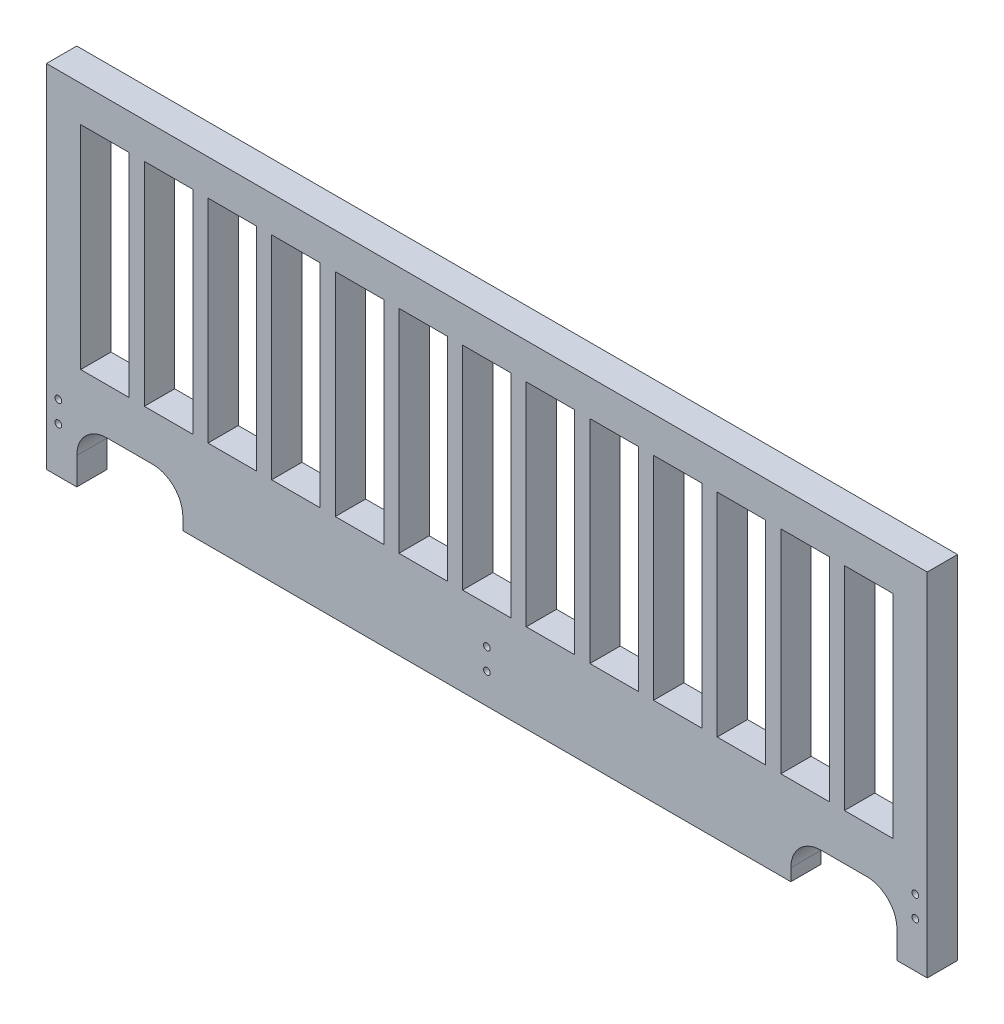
from build123d import *

# Parameters (mm, degrees)
ESQUISSE5_R      = 1.1
ESQUISSE5_W      = 16
ESQUISSE5_H      = 70
ESQUISSE5_W_2    = 15.999999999
EXTRUSION1_DEPTH = 10


with BuildPart() as part:
    # Esquisse5 → Extrusion1 (new body)
    with BuildSketch(Plane.XY):
        with BuildLine():
            Line((-3.926990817, 116), (286.670329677, 116))
            Line((286.670329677, 116), (286.673301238, 4e-09))
            Line((286.673301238, 4e-09), (276.673301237, 4e-09))
            Line((276.673301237, 4e-09), (276.673301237, 9))
            ThreePointArc((276.673301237, 9), (273.744369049, 16.071067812), (266.673301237, 19))
            Line((266.673301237, 19), (251.673301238, 19))
            ThreePointArc((251.673301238, 19), (244.602233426, 16.071067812), (241.673301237, 9))
            Line((241.673301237, 9), (241.673301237, 5))
            Line((241.673301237, 5), (41.073009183, 5))
            Line((41.073009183, 5), (41.073009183, 9))
            ThreePointArc((41.073009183, 9), (38.144076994, 16.071067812), (31.073009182, 19))
            Line((31.073009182, 19), (16.073009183, 19))
            ThreePointArc((16.073009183, 19), (9.001941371, 16.071067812), (6.073009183, 9))
            Line((6.073009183, 9), (6.073009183, 4e-09))
            Line((6.073009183, 4e-09), (-3.926990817, 4e-09))
            Line((-3.926990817, 4e-09), (-3.926990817, 116))
        make_face()
        with Locations((0, 22)):
            Circle(ESQUISSE5_R, mode=Mode.SUBTRACT)
        with Locations((141.37315521, 22)):
            Circle(ESQUISSE5_R, mode=Mode.SUBTRACT)
        with Locations((282.74333886, 22)):
            Circle(ESQUISSE5_R, mode=Mode.SUBTRACT)
        with Locations((0, 15)):
            Circle(ESQUISSE5_R, mode=Mode.SUBTRACT)
        with Locations((141.37315521, 15)):
            Circle(ESQUISSE5_R, mode=Mode.SUBTRACT)
        with Locations((282.74333886, 15)):
            Circle(ESQUISSE5_R, mode=Mode.SUBTRACT)
        Polygon((28.373009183, 104.2), (44.373009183, 104.2), (44.373009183, 34.2), (28.373009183, 34.2), align=None, mode=Mode.SUBTRACT)
        with Locations((15.373009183, 69.2)):
            Rectangle(ESQUISSE5_W, ESQUISSE5_H, mode=Mode.SUBTRACT)
        with Locations((57.373009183, 69.2)):
            Rectangle(ESQUISSE5_W, ESQUISSE5_H, mode=Mode.SUBTRACT)
        with Locations((78.373009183, 69.2)):
            Rectangle(ESQUISSE5_W, ESQUISSE5_H, mode=Mode.SUBTRACT)
        with Locations((99.373009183, 69.2)):
            Rectangle(ESQUISSE5_W, ESQUISSE5_H, mode=Mode.SUBTRACT)
        with Locations((120.373009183, 69.2)):
            Rectangle(ESQUISSE5_W, ESQUISSE5_H, mode=Mode.SUBTRACT)
        with Locations((141.373009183, 69.2)):
            Rectangle(ESQUISSE5_W, ESQUISSE5_H, mode=Mode.SUBTRACT)
        with Locations((162.373009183, 69.2)):
            Rectangle(ESQUISSE5_W_2, ESQUISSE5_H, mode=Mode.SUBTRACT)
        with Locations((183.373009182, 69.2)):
            Rectangle(ESQUISSE5_W, ESQUISSE5_H, mode=Mode.SUBTRACT)
        with Locations((204.373009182, 69.2)):
            Rectangle(ESQUISSE5_W, ESQUISSE5_H, mode=Mode.SUBTRACT)
        with Locations((225.373009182, 69.2)):
            Rectangle(ESQUISSE5_W, ESQUISSE5_H, mode=Mode.SUBTRACT)
        with Locations((246.373009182, 69.2)):
            Rectangle(ESQUISSE5_W, ESQUISSE5_H, mode=Mode.SUBTRACT)
        with Locations((267.373009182, 69.2)):
            Rectangle(ESQUISSE5_W, ESQUISSE5_H, mode=Mode.SUBTRACT)
    extrude(amount=EXTRUSION1_DEPTH)


solid = part.part
